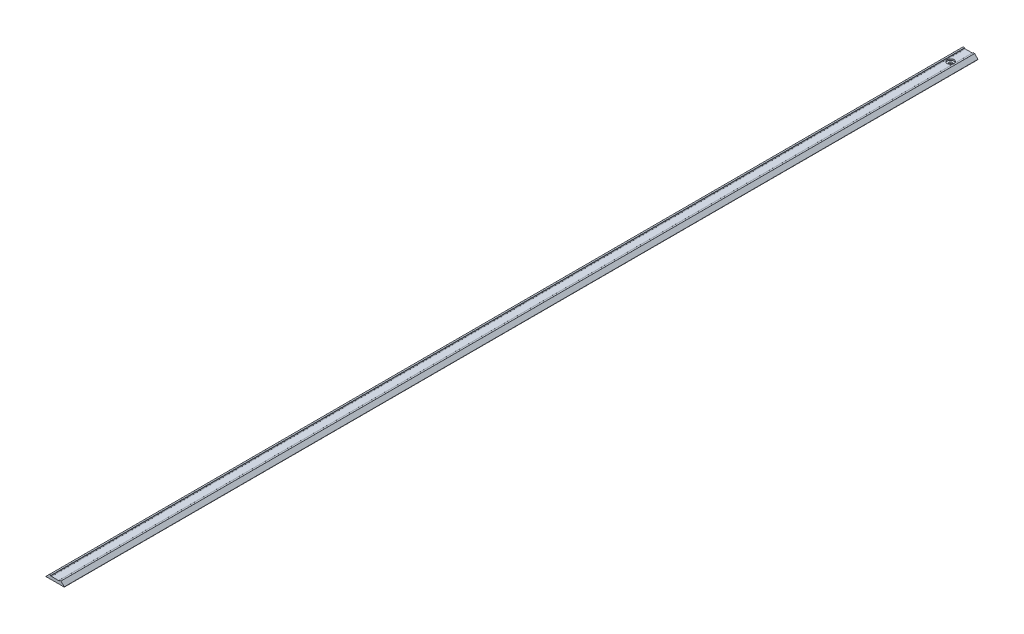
ISO-10303-21;
HEADER;
FILE_DESCRIPTION(('STEP AP214'),'2;1');
FILE_NAME('part.step','',(''),(''),'','','');
FILE_SCHEMA(('AUTOMOTIVE_DESIGN { 1 0 10303 214 1 1 1 1 }'));
ENDSEC;
DATA;
#1=APPLICATION_CONTEXT('core data for automotive mechanical design processes');
#2=APPLICATION_PROTOCOL_DEFINITION('international standard','automotive_design',2000,#1);
#3=PRODUCT_CONTEXT('',#1,'mechanical');
#4=PRODUCT('Part','Part','',(#3));
#5=PRODUCT_RELATED_PRODUCT_CATEGORY('part','',(#4));
#6=PRODUCT_DEFINITION_FORMATION('','',#4);
#7=PRODUCT_DEFINITION_CONTEXT('part definition',#1,'design');
#8=PRODUCT_DEFINITION('design','',#6,#7);
#9=PRODUCT_DEFINITION_SHAPE('','',#8);
#10=(LENGTH_UNIT() NAMED_UNIT(*) SI_UNIT(.MILLI.,.METRE.));
#11=(NAMED_UNIT(*) PLANE_ANGLE_UNIT() SI_UNIT($,.RADIAN.));
#12=(NAMED_UNIT(*) SI_UNIT($,.STERADIAN.) SOLID_ANGLE_UNIT());
#13=UNCERTAINTY_MEASURE_WITH_UNIT(LENGTH_MEASURE(1.E-05),#10,'distance_accuracy_value','');
#14=(GEOMETRIC_REPRESENTATION_CONTEXT(3) GLOBAL_UNCERTAINTY_ASSIGNED_CONTEXT((#13)) GLOBAL_UNIT_ASSIGNED_CONTEXT((#10,
#11,#12)) REPRESENTATION_CONTEXT('',''));
#15=CARTESIAN_POINT('',(0.,0.,0.));
#16=DIRECTION('',(0.,0.,1.));
#17=DIRECTION('',(1.,0.,0.));
#18=AXIS2_PLACEMENT_3D('',#15,#16,#17);
#19=CARTESIAN_POINT('',(3.,0.0499999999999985,1000.));
#20=DIRECTION('',(-1.,0.,0.));
#21=DIRECTION('',(0.,-1.,0.));
#22=AXIS2_PLACEMENT_3D('',#19,#20,#21);
#23=PLANE('',#22);
#24=DIRECTION('',(0.,1.,0.));
#25=VECTOR('',#24,1.);
#26=CARTESIAN_POINT('',(3.,0.0499999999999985,0.));
#27=LINE('',#26,#25);
#28=CARTESIAN_POINT('',(3.,0.,0.));
#29=VERTEX_POINT('',#28);
#30=CARTESIAN_POINT('',(3.,0.0499999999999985,0.));
#31=VERTEX_POINT('',#30);
#32=EDGE_CURVE('E300',#29,#31,#27,.T.);
#33=ORIENTED_EDGE('',*,*,#32,.T.);
#34=DIRECTION('',(0.,0.,-1.));
#35=VECTOR('',#34,1.);
#36=CARTESIAN_POINT('',(3.,0.0499999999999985,1000.));
#37=LINE('',#36,#35);
#38=CARTESIAN_POINT('',(3.,0.0499999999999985,1000.));
#39=VERTEX_POINT('',#38);
#40=EDGE_CURVE('E11',#39,#31,#37,.T.);
#41=ORIENTED_EDGE('',*,*,#40,.F.);
#42=DIRECTION('',(0.,1.,0.));
#43=VECTOR('',#42,1.);
#44=CARTESIAN_POINT('',(3.,0.0499999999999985,1000.));
#45=LINE('',#44,#43);
#46=CARTESIAN_POINT('',(3.,0.,1000.));
#47=VERTEX_POINT('',#46);
#48=EDGE_CURVE('E371',#47,#39,#45,.T.);
#49=ORIENTED_EDGE('',*,*,#48,.F.);
#50=DIRECTION('',(0.,0.,-1.));
#51=VECTOR('',#50,1.);
#52=CARTESIAN_POINT('',(3.,0.,1000.));
#53=LINE('',#52,#51);
#54=EDGE_CURVE('E296',#47,#29,#53,.T.);
#55=ORIENTED_EDGE('',*,*,#54,.T.);
#56=EDGE_LOOP('',(#33,#41,#49,#55));
#57=FACE_BOUND('',#56,.T.);
#58=ADVANCED_FACE('F35',(#57),#23,.F.);
#59=CARTESIAN_POINT('',(17.,0.0500000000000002,1000.));
#60=DIRECTION('',(0.,1.,0.));
#61=DIRECTION('',(-1.,0.,0.));
#62=AXIS2_PLACEMENT_3D('',#59,#60,#61);
#63=PLANE('',#62);
#64=CARTESIAN_POINT('',(10.,0.0499999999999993,20.));
#65=DIRECTION('',(0.,1.,0.));
#66=DIRECTION('',(-1.,0.,0.));
#67=AXIS2_PLACEMENT_3D('',#64,#65,#66);
#68=CIRCLE('',#67,1.7);
#69=CARTESIAN_POINT('',(8.30000000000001,0.0499999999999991,20.));
#70=VERTEX_POINT('',#69);
#71=EDGE_CURVE('E38',#70,#70,#68,.T.);
#72=ORIENTED_EDGE('',*,*,#71,.T.);
#73=EDGE_LOOP('',(#72));
#74=FACE_BOUND('',#73,.T.);
#75=DIRECTION('',(1.,0.,0.));
#76=VECTOR('',#75,1.);
#77=CARTESIAN_POINT('',(17.,0.0500000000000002,0.));
#78=LINE('',#77,#76);
#79=CARTESIAN_POINT('',(17.,0.0500000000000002,0.));
#80=VERTEX_POINT('',#79);
#81=EDGE_CURVE('E303',#31,#80,#78,.T.);
#82=ORIENTED_EDGE('',*,*,#81,.T.);
#83=DIRECTION('',(0.,0.,-1.));
#84=VECTOR('',#83,1.);
#85=CARTESIAN_POINT('',(17.,0.0500000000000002,1000.));
#86=LINE('',#85,#84);
#87=CARTESIAN_POINT('',(17.,0.0500000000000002,1000.));
#88=VERTEX_POINT('',#87);
#89=EDGE_CURVE('E44',#88,#80,#86,.T.);
#90=ORIENTED_EDGE('',*,*,#89,.F.);
#91=DIRECTION('',(1.,0.,0.));
#92=VECTOR('',#91,1.);
#93=CARTESIAN_POINT('',(17.,0.0500000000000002,1000.));
#94=LINE('',#93,#92);
#95=EDGE_CURVE('E179',#39,#88,#94,.T.);
#96=ORIENTED_EDGE('',*,*,#95,.F.);
#97=ORIENTED_EDGE('',*,*,#40,.T.);
#98=EDGE_LOOP('',(#82,#90,#96,#97));
#99=FACE_BOUND('',#98,.T.);
#100=ADVANCED_FACE('F570',(#74,#99),#63,.F.);
#101=CARTESIAN_POINT('',(17.,0.,1000.));
#102=DIRECTION('',(1.,0.,0.));
#103=DIRECTION('',(0.,0.,-1.));
#104=AXIS2_PLACEMENT_3D('',#101,#102,#103);
#105=PLANE('',#104);
#106=DIRECTION('',(0.,-1.,0.));
#107=VECTOR('',#106,1.);
#108=CARTESIAN_POINT('',(17.,0.,0.));
#109=LINE('',#108,#107);
#110=CARTESIAN_POINT('',(17.,0.,0.));
#111=VERTEX_POINT('',#110);
#112=EDGE_CURVE('E305',#80,#111,#109,.T.);
#113=ORIENTED_EDGE('',*,*,#112,.T.);
#114=DIRECTION('',(0.,0.,-1.));
#115=VECTOR('',#114,1.);
#116=CARTESIAN_POINT('',(17.,0.,1000.));
#117=LINE('',#116,#115);
#118=CARTESIAN_POINT('',(17.,0.,1000.));
#119=VERTEX_POINT('',#118);
#120=EDGE_CURVE('E462',#119,#111,#117,.T.);
#121=ORIENTED_EDGE('',*,*,#120,.F.);
#122=DIRECTION('',(0.,-1.,0.));
#123=VECTOR('',#122,1.);
#124=CARTESIAN_POINT('',(17.,0.,1000.));
#125=LINE('',#124,#123);
#126=EDGE_CURVE('E471',#88,#119,#125,.T.);
#127=ORIENTED_EDGE('',*,*,#126,.F.);
#128=ORIENTED_EDGE('',*,*,#89,.T.);
#129=EDGE_LOOP('',(#113,#121,#127,#128));
#130=FACE_BOUND('',#129,.T.);
#131=ADVANCED_FACE('F469',(#130),#105,.F.);
#132=CARTESIAN_POINT('',(19.9,0.,1000.));
#133=DIRECTION('',(0.,1.,0.));
#134=DIRECTION('',(-1.,0.,0.));
#135=AXIS2_PLACEMENT_3D('',#132,#133,#134);
#136=PLANE('',#135);
#137=DIRECTION('',(1.,0.,0.));
#138=VECTOR('',#137,1.);
#139=CARTESIAN_POINT('',(19.9,0.,0.));
#140=LINE('',#139,#138);
#141=CARTESIAN_POINT('',(19.9,0.,0.));
#142=VERTEX_POINT('',#141);
#143=EDGE_CURVE('E307',#111,#142,#140,.T.);
#144=ORIENTED_EDGE('',*,*,#143,.T.);
#145=DIRECTION('',(0.,0.,-1.));
#146=VECTOR('',#145,1.);
#147=CARTESIAN_POINT('',(19.9,0.,1000.));
#148=LINE('',#147,#146);
#149=CARTESIAN_POINT('',(19.9,0.,1000.));
#150=VERTEX_POINT('',#149);
#151=EDGE_CURVE('E459',#150,#142,#148,.T.);
#152=ORIENTED_EDGE('',*,*,#151,.F.);
#153=DIRECTION('',(1.,0.,0.));
#154=VECTOR('',#153,1.);
#155=CARTESIAN_POINT('',(19.9,0.,1000.));
#156=LINE('',#155,#154);
#157=EDGE_CURVE('E489',#119,#150,#156,.T.);
#158=ORIENTED_EDGE('',*,*,#157,.F.);
#159=ORIENTED_EDGE('',*,*,#120,.T.);
#160=EDGE_LOOP('',(#144,#152,#158,#159));
#161=FACE_BOUND('',#160,.T.);
#162=ADVANCED_FACE('F480',(#161),#136,.F.);
#163=CARTESIAN_POINT('',(19.9,0.1,1000.));
#164=DIRECTION('',(0.,0.,-1.));
#165=DIRECTION('',(-1.,0.,0.));
#166=AXIS2_PLACEMENT_3D('',#163,#164,#165);
#167=CYLINDRICAL_SURFACE('',#166,0.0999999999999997);
#168=CARTESIAN_POINT('',(19.9,0.1,0.));
#169=DIRECTION('',(0.,0.,1.));
#170=DIRECTION('',(-1.,0.,0.));
#171=AXIS2_PLACEMENT_3D('',#168,#169,#170);
#172=CIRCLE('',#171,0.0999999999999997);
#173=CARTESIAN_POINT('',(20.,0.1,0.));
#174=VERTEX_POINT('',#173);
#175=EDGE_CURVE('E309',#142,#174,#172,.T.);
#176=ORIENTED_EDGE('',*,*,#175,.T.);
#177=DIRECTION('',(0.,0.,-1.));
#178=VECTOR('',#177,1.);
#179=CARTESIAN_POINT('',(20.,0.1,1000.));
#180=LINE('',#179,#178);
#181=CARTESIAN_POINT('',(20.,0.1,1000.));
#182=VERTEX_POINT('',#181);
#183=EDGE_CURVE('E456',#182,#174,#180,.T.);
#184=ORIENTED_EDGE('',*,*,#183,.F.);
#185=CARTESIAN_POINT('',(19.9,0.1,1000.));
#186=DIRECTION('',(0.,0.,1.));
#187=DIRECTION('',(-1.,0.,0.));
#188=AXIS2_PLACEMENT_3D('',#185,#186,#187);
#189=CIRCLE('',#188,0.0999999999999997);
#190=EDGE_CURVE('E486',#150,#182,#189,.T.);
#191=ORIENTED_EDGE('',*,*,#190,.F.);
#192=ORIENTED_EDGE('',*,*,#151,.T.);
#193=EDGE_LOOP('',(#176,#184,#191,#192));
#194=FACE_BOUND('',#193,.T.);
#195=ADVANCED_FACE('F484',(#194),#167,.T.);
#196=CARTESIAN_POINT('',(20.,0.25857864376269,1000.));
#197=DIRECTION('',(-1.,0.,0.));
#198=DIRECTION('',(0.,0.,1.));
#199=AXIS2_PLACEMENT_3D('',#196,#197,#198);
#200=PLANE('',#199);
#201=DIRECTION('',(0.,1.,0.));
#202=VECTOR('',#201,1.);
#203=CARTESIAN_POINT('',(20.,0.25857864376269,0.));
#204=LINE('',#203,#202);
#205=CARTESIAN_POINT('',(20.,0.25857864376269,0.));
#206=VERTEX_POINT('',#205);
#207=EDGE_CURVE('E311',#174,#206,#204,.T.);
#208=ORIENTED_EDGE('',*,*,#207,.T.);
#209=DIRECTION('',(0.,0.,-1.));
#210=VECTOR('',#209,1.);
#211=CARTESIAN_POINT('',(20.,0.25857864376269,1000.));
#212=LINE('',#211,#210);
#213=CARTESIAN_POINT('',(20.,0.25857864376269,1000.));
#214=VERTEX_POINT('',#213);
#215=EDGE_CURVE('E453',#214,#206,#212,.T.);
#216=ORIENTED_EDGE('',*,*,#215,.F.);
#217=DIRECTION('',(0.,1.,0.));
#218=VECTOR('',#217,1.);
#219=CARTESIAN_POINT('',(20.,0.25857864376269,1000.));
#220=LINE('',#219,#218);
#221=EDGE_CURVE('E488',#182,#214,#220,.T.);
#222=ORIENTED_EDGE('',*,*,#221,.F.);
#223=ORIENTED_EDGE('',*,*,#183,.T.);
#224=EDGE_LOOP('',(#208,#216,#222,#223));
#225=FACE_BOUND('',#224,.T.);
#226=ADVANCED_FACE('F585',(#225),#200,.F.);
#227=CARTESIAN_POINT('',(19.9,0.258578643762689,1000.));
#228=DIRECTION('',(0.,0.,-1.));
#229=DIRECTION('',(-1.,0.,0.));
#230=AXIS2_PLACEMENT_3D('',#227,#228,#229);
#231=CYLINDRICAL_SURFACE('',#230,0.0999999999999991);
#232=CARTESIAN_POINT('',(19.9,0.258578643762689,0.));
#233=DIRECTION('',(0.,0.,1.));
#234=DIRECTION('',(-1.,0.,0.));
#235=AXIS2_PLACEMENT_3D('',#232,#233,#234);
#236=CIRCLE('',#235,0.0999999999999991);
#237=CARTESIAN_POINT('',(19.9707106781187,0.329289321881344,0.));
#238=VERTEX_POINT('',#237);
#239=EDGE_CURVE('E313',#206,#238,#236,.T.);
#240=ORIENTED_EDGE('',*,*,#239,.T.);
#241=DIRECTION('',(0.,0.,-1.));
#242=VECTOR('',#241,1.);
#243=CARTESIAN_POINT('',(19.9707106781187,0.329289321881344,1000.));
#244=LINE('',#243,#242);
#245=CARTESIAN_POINT('',(19.9707106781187,0.329289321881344,1000.));
#246=VERTEX_POINT('',#245);
#247=EDGE_CURVE('E450',#246,#238,#244,.T.);
#248=ORIENTED_EDGE('',*,*,#247,.F.);
#249=CARTESIAN_POINT('',(19.9,0.258578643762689,1000.));
#250=DIRECTION('',(0.,0.,1.));
#251=DIRECTION('',(-1.,0.,0.));
#252=AXIS2_PLACEMENT_3D('',#249,#250,#251);
#253=CIRCLE('',#252,0.0999999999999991);
#254=EDGE_CURVE('E491',#214,#246,#253,.T.);
#255=ORIENTED_EDGE('',*,*,#254,.F.);
#256=ORIENTED_EDGE('',*,*,#215,.T.);
#257=EDGE_LOOP('',(#240,#248,#255,#256));
#258=FACE_BOUND('',#257,.T.);
#259=ADVANCED_FACE('F588',(#258),#231,.T.);
#260=CARTESIAN_POINT('',(16.3292893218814,3.97071067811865,1000.));
#261=DIRECTION('',(-0.707106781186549,-0.707106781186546,0.));
#262=DIRECTION('',(0.707106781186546,-0.707106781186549,0.));
#263=AXIS2_PLACEMENT_3D('',#260,#261,#262);
#264=PLANE('',#263);
#265=DIRECTION('',(-0.707106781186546,0.707106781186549,0.));
#266=VECTOR('',#265,1.);
#267=CARTESIAN_POINT('',(16.3292893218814,3.97071067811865,0.));
#268=LINE('',#267,#266);
#269=CARTESIAN_POINT('',(16.3292893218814,3.97071067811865,0.));
#270=VERTEX_POINT('',#269);
#271=EDGE_CURVE('E315',#238,#270,#268,.T.);
#272=ORIENTED_EDGE('',*,*,#271,.T.);
#273=DIRECTION('',(0.,0.,-1.));
#274=VECTOR('',#273,1.);
#275=CARTESIAN_POINT('',(16.3292893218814,3.97071067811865,1000.));
#276=LINE('',#275,#274);
#277=CARTESIAN_POINT('',(16.3292893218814,3.97071067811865,1000.));
#278=VERTEX_POINT('',#277);
#279=EDGE_CURVE('E447',#278,#270,#276,.T.);
#280=ORIENTED_EDGE('',*,*,#279,.F.);
#281=DIRECTION('',(-0.707106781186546,0.707106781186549,0.));
#282=VECTOR('',#281,1.);
#283=CARTESIAN_POINT('',(16.3292893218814,3.97071067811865,1000.));
#284=LINE('',#283,#282);
#285=EDGE_CURVE('E497',#246,#278,#284,.T.);
#286=ORIENTED_EDGE('',*,*,#285,.F.);
#287=ORIENTED_EDGE('',*,*,#247,.T.);
#288=EDGE_LOOP('',(#272,#280,#286,#287));
#289=FACE_BOUND('',#288,.T.);
#290=ADVANCED_FACE('F592',(#289),#264,.F.);
#291=CARTESIAN_POINT('',(16.2585786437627,3.9,1000.));
#292=DIRECTION('',(0.,0.,-1.));
#293=DIRECTION('',(-1.,0.,0.));
#294=AXIS2_PLACEMENT_3D('',#291,#292,#293);
#295=CYLINDRICAL_SURFACE('',#294,0.100000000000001);
#296=CARTESIAN_POINT('',(16.2585786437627,3.9,0.));
#297=DIRECTION('',(0.,0.,1.));
#298=DIRECTION('',(1.,0.,0.));
#299=AXIS2_PLACEMENT_3D('',#296,#297,#298);
#300=CIRCLE('',#299,0.100000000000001);
#301=CARTESIAN_POINT('',(16.2585786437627,4.,0.));
#302=VERTEX_POINT('',#301);
#303=EDGE_CURVE('E317',#270,#302,#300,.T.);
#304=ORIENTED_EDGE('',*,*,#303,.T.);
#305=DIRECTION('',(0.,0.,-1.));
#306=VECTOR('',#305,1.);
#307=CARTESIAN_POINT('',(16.2585786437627,4.,1000.));
#308=LINE('',#307,#306);
#309=CARTESIAN_POINT('',(16.2585786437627,4.,1000.));
#310=VERTEX_POINT('',#309);
#311=EDGE_CURVE('E444',#310,#302,#308,.T.);
#312=ORIENTED_EDGE('',*,*,#311,.F.);
#313=CARTESIAN_POINT('',(16.2585786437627,3.9,1000.));
#314=DIRECTION('',(0.,0.,1.));
#315=DIRECTION('',(1.,0.,0.));
#316=AXIS2_PLACEMENT_3D('',#313,#314,#315);
#317=CIRCLE('',#316,0.100000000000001);
#318=EDGE_CURVE('E499',#278,#310,#317,.T.);
#319=ORIENTED_EDGE('',*,*,#318,.F.);
#320=ORIENTED_EDGE('',*,*,#279,.T.);
#321=EDGE_LOOP('',(#304,#312,#319,#320));
#322=FACE_BOUND('',#321,.T.);
#323=ADVANCED_FACE('F596',(#322),#295,.T.);
#324=CARTESIAN_POINT('',(14.65,4.,1000.));
#325=DIRECTION('',(0.,-1.,0.));
#326=DIRECTION('',(1.,0.,0.));
#327=AXIS2_PLACEMENT_3D('',#324,#325,#326);
#328=PLANE('',#327);
#329=DIRECTION('',(-1.,0.,0.));
#330=VECTOR('',#329,1.);
#331=CARTESIAN_POINT('',(14.65,4.,0.));
#332=LINE('',#331,#330);
#333=CARTESIAN_POINT('',(14.65,4.,0.));
#334=VERTEX_POINT('',#333);
#335=EDGE_CURVE('E319',#302,#334,#332,.T.);
#336=ORIENTED_EDGE('',*,*,#335,.T.);
#337=DIRECTION('',(0.,0.,-1.));
#338=VECTOR('',#337,1.);
#339=CARTESIAN_POINT('',(14.65,4.,1000.));
#340=LINE('',#339,#338);
#341=CARTESIAN_POINT('',(14.65,4.,1000.));
#342=VERTEX_POINT('',#341);
#343=EDGE_CURVE('E441',#342,#334,#340,.T.);
#344=ORIENTED_EDGE('',*,*,#343,.F.);
#345=DIRECTION('',(-1.,0.,0.));
#346=VECTOR('',#345,1.);
#347=CARTESIAN_POINT('',(14.65,4.,1000.));
#348=LINE('',#347,#346);
#349=EDGE_CURVE('E501',#310,#342,#348,.T.);
#350=ORIENTED_EDGE('',*,*,#349,.F.);
#351=ORIENTED_EDGE('',*,*,#311,.T.);
#352=EDGE_LOOP('',(#336,#344,#350,#351));
#353=FACE_BOUND('',#352,.T.);
#354=ADVANCED_FACE('F600',(#353),#328,.F.);
#355=CARTESIAN_POINT('',(14.65,3.85,1000.));
#356=DIRECTION('',(0.,0.,-1.));
#357=DIRECTION('',(-1.,0.,0.));
#358=AXIS2_PLACEMENT_3D('',#355,#356,#357);
#359=CYLINDRICAL_SURFACE('',#358,0.150000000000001);
#360=CARTESIAN_POINT('',(14.65,3.85,0.));
#361=DIRECTION('',(0.,0.,1.));
#362=DIRECTION('',(1.,0.,0.));
#363=AXIS2_PLACEMENT_3D('',#360,#361,#362);
#364=CIRCLE('',#363,0.150000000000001);
#365=CARTESIAN_POINT('',(14.5,3.85,0.));
#366=VERTEX_POINT('',#365);
#367=EDGE_CURVE('E321',#334,#366,#364,.T.);
#368=ORIENTED_EDGE('',*,*,#367,.T.);
#369=DIRECTION('',(0.,0.,-1.));
#370=VECTOR('',#369,1.);
#371=CARTESIAN_POINT('',(14.5,3.85,1000.));
#372=LINE('',#371,#370);
#373=CARTESIAN_POINT('',(14.5,3.85,1000.));
#374=VERTEX_POINT('',#373);
#375=EDGE_CURVE('E438',#374,#366,#372,.T.);
#376=ORIENTED_EDGE('',*,*,#375,.F.);
#377=CARTESIAN_POINT('',(14.65,3.85,1000.));
#378=DIRECTION('',(0.,0.,1.));
#379=DIRECTION('',(1.,0.,0.));
#380=AXIS2_PLACEMENT_3D('',#377,#378,#379);
#381=CIRCLE('',#380,0.150000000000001);
#382=EDGE_CURVE('E503',#342,#374,#381,.T.);
#383=ORIENTED_EDGE('',*,*,#382,.F.);
#384=ORIENTED_EDGE('',*,*,#343,.T.);
#385=EDGE_LOOP('',(#368,#376,#383,#384));
#386=FACE_BOUND('',#385,.T.);
#387=ADVANCED_FACE('F604',(#386),#359,.T.);
#388=CARTESIAN_POINT('',(14.5,3.75,1000.));
#389=DIRECTION('',(1.,0.,0.));
#390=DIRECTION('',(0.,0.,-1.));
#391=AXIS2_PLACEMENT_3D('',#388,#389,#390);
#392=PLANE('',#391);
#393=DIRECTION('',(0.,-1.,0.));
#394=VECTOR('',#393,1.);
#395=CARTESIAN_POINT('',(14.5,3.75,0.));
#396=LINE('',#395,#394);
#397=CARTESIAN_POINT('',(14.5,3.75,0.));
#398=VERTEX_POINT('',#397);
#399=EDGE_CURVE('E323',#366,#398,#396,.T.);
#400=ORIENTED_EDGE('',*,*,#399,.T.);
#401=DIRECTION('',(0.,0.,-1.));
#402=VECTOR('',#401,1.);
#403=CARTESIAN_POINT('',(14.5,3.75,1000.));
#404=LINE('',#403,#402);
#405=CARTESIAN_POINT('',(14.5,3.75,1000.));
#406=VERTEX_POINT('',#405);
#407=EDGE_CURVE('E435',#406,#398,#404,.T.);
#408=ORIENTED_EDGE('',*,*,#407,.F.);
#409=DIRECTION('',(0.,-1.,0.));
#410=VECTOR('',#409,1.);
#411=CARTESIAN_POINT('',(14.5,3.75,1000.));
#412=LINE('',#411,#410);
#413=EDGE_CURVE('E505',#374,#406,#412,.T.);
#414=ORIENTED_EDGE('',*,*,#413,.F.);
#415=ORIENTED_EDGE('',*,*,#375,.T.);
#416=EDGE_LOOP('',(#400,#408,#414,#415));
#417=FACE_BOUND('',#416,.T.);
#418=ADVANCED_FACE('F608',(#417),#392,.F.);
#419=CARTESIAN_POINT('',(14.65,3.75,1000.));
#420=DIRECTION('',(0.,0.,-1.));
#421=DIRECTION('',(-1.,0.,0.));
#422=AXIS2_PLACEMENT_3D('',#419,#420,#421);
#423=CYLINDRICAL_SURFACE('',#422,0.15);
#424=CARTESIAN_POINT('',(14.65,3.75,0.));
#425=DIRECTION('',(0.,0.,1.));
#426=DIRECTION('',(1.,0.,0.));
#427=AXIS2_PLACEMENT_3D('',#424,#425,#426);
#428=CIRCLE('',#427,0.15);
#429=CARTESIAN_POINT('',(14.65,3.6,0.));
#430=VERTEX_POINT('',#429);
#431=EDGE_CURVE('E325',#398,#430,#428,.T.);
#432=ORIENTED_EDGE('',*,*,#431,.T.);
#433=DIRECTION('',(0.,0.,-1.));
#434=VECTOR('',#433,1.);
#435=CARTESIAN_POINT('',(14.65,3.6,1000.));
#436=LINE('',#435,#434);
#437=CARTESIAN_POINT('',(14.65,3.6,1000.));
#438=VERTEX_POINT('',#437);
#439=EDGE_CURVE('E432',#438,#430,#436,.T.);
#440=ORIENTED_EDGE('',*,*,#439,.F.);
#441=CARTESIAN_POINT('',(14.65,3.75,1000.));
#442=DIRECTION('',(0.,0.,1.));
#443=DIRECTION('',(1.,0.,0.));
#444=AXIS2_PLACEMENT_3D('',#441,#442,#443);
#445=CIRCLE('',#444,0.15);
#446=EDGE_CURVE('E507',#406,#438,#445,.T.);
#447=ORIENTED_EDGE('',*,*,#446,.F.);
#448=ORIENTED_EDGE('',*,*,#407,.T.);
#449=EDGE_LOOP('',(#432,#440,#447,#448));
#450=FACE_BOUND('',#449,.T.);
#451=ADVANCED_FACE('F612',(#450),#423,.T.);
#452=CARTESIAN_POINT('',(14.975,3.6,1000.));
#453=DIRECTION('',(0.,1.,0.));
#454=DIRECTION('',(0.,0.,1.));
#455=AXIS2_PLACEMENT_3D('',#452,#453,#454);
#456=PLANE('',#455);
#457=DIRECTION('',(1.,0.,0.));
#458=VECTOR('',#457,1.);
#459=CARTESIAN_POINT('',(14.975,3.6,0.));
#460=LINE('',#459,#458);
#461=CARTESIAN_POINT('',(14.975,3.6,0.));
#462=VERTEX_POINT('',#461);
#463=EDGE_CURVE('E327',#430,#462,#460,.T.);
#464=ORIENTED_EDGE('',*,*,#463,.T.);
#465=DIRECTION('',(0.,0.,-1.));
#466=VECTOR('',#465,1.);
#467=CARTESIAN_POINT('',(14.975,3.6,1000.));
#468=LINE('',#467,#466);
#469=CARTESIAN_POINT('',(14.975,3.6,1000.));
#470=VERTEX_POINT('',#469);
#471=EDGE_CURVE('E429',#470,#462,#468,.T.);
#472=ORIENTED_EDGE('',*,*,#471,.F.);
#473=DIRECTION('',(1.,0.,0.));
#474=VECTOR('',#473,1.);
#475=CARTESIAN_POINT('',(14.975,3.6,1000.));
#476=LINE('',#475,#474);
#477=EDGE_CURVE('E509',#438,#470,#476,.T.);
#478=ORIENTED_EDGE('',*,*,#477,.F.);
#479=ORIENTED_EDGE('',*,*,#439,.T.);
#480=EDGE_LOOP('',(#464,#472,#478,#479));
#481=FACE_BOUND('',#480,.T.);
#482=ADVANCED_FACE('F616',(#481),#456,.F.);
#483=CARTESIAN_POINT('',(14.975,3.45,1000.));
#484=DIRECTION('',(0.,0.,-1.));
#485=DIRECTION('',(-1.,0.,0.));
#486=AXIS2_PLACEMENT_3D('',#483,#484,#485);
#487=CYLINDRICAL_SURFACE('',#486,0.15);
#488=CARTESIAN_POINT('',(14.975,3.45,0.));
#489=DIRECTION('',(0.,0.,-1.));
#490=DIRECTION('',(-1.,0.,0.));
#491=AXIS2_PLACEMENT_3D('',#488,#489,#490);
#492=CIRCLE('',#491,0.15);
#493=CARTESIAN_POINT('',(15.125,3.45,0.));
#494=VERTEX_POINT('',#493);
#495=EDGE_CURVE('E329',#462,#494,#492,.T.);
#496=ORIENTED_EDGE('',*,*,#495,.T.);
#497=DIRECTION('',(0.,0.,-1.));
#498=VECTOR('',#497,1.);
#499=CARTESIAN_POINT('',(15.125,3.45,1000.));
#500=LINE('',#499,#498);
#501=CARTESIAN_POINT('',(15.125,3.45,1000.));
#502=VERTEX_POINT('',#501);
#503=EDGE_CURVE('E426',#502,#494,#500,.T.);
#504=ORIENTED_EDGE('',*,*,#503,.F.);
#505=CARTESIAN_POINT('',(14.975,3.45,1000.));
#506=DIRECTION('',(0.,0.,-1.));
#507=DIRECTION('',(-1.,0.,0.));
#508=AXIS2_PLACEMENT_3D('',#505,#506,#507);
#509=CIRCLE('',#508,0.15);
#510=EDGE_CURVE('E511',#470,#502,#509,.T.);
#511=ORIENTED_EDGE('',*,*,#510,.F.);
#512=ORIENTED_EDGE('',*,*,#471,.T.);
#513=EDGE_LOOP('',(#496,#504,#511,#512));
#514=FACE_BOUND('',#513,.T.);
#515=ADVANCED_FACE('F620',(#514),#487,.F.);
#516=CARTESIAN_POINT('',(15.125,3.4,1000.));
#517=DIRECTION('',(1.,0.,0.));
#518=DIRECTION('',(0.,0.,-1.));
#519=AXIS2_PLACEMENT_3D('',#516,#517,#518);
#520=PLANE('',#519);
#521=DIRECTION('',(0.,-1.,0.));
#522=VECTOR('',#521,1.);
#523=CARTESIAN_POINT('',(15.125,3.4,0.));
#524=LINE('',#523,#522);
#525=CARTESIAN_POINT('',(15.125,3.4,0.));
#526=VERTEX_POINT('',#525);
#527=EDGE_CURVE('E331',#494,#526,#524,.T.);
#528=ORIENTED_EDGE('',*,*,#527,.T.);
#529=DIRECTION('',(0.,0.,-1.));
#530=VECTOR('',#529,1.);
#531=CARTESIAN_POINT('',(15.125,3.4,1000.));
#532=LINE('',#531,#530);
#533=CARTESIAN_POINT('',(15.125,3.4,1000.));
#534=VERTEX_POINT('',#533);
#535=EDGE_CURVE('E423',#534,#526,#532,.T.);
#536=ORIENTED_EDGE('',*,*,#535,.F.);
#537=DIRECTION('',(0.,-1.,0.));
#538=VECTOR('',#537,1.);
#539=CARTESIAN_POINT('',(15.125,3.4,1000.));
#540=LINE('',#539,#538);
#541=EDGE_CURVE('E513',#502,#534,#540,.T.);
#542=ORIENTED_EDGE('',*,*,#541,.F.);
#543=ORIENTED_EDGE('',*,*,#503,.T.);
#544=EDGE_LOOP('',(#528,#536,#542,#543));
#545=FACE_BOUND('',#544,.T.);
#546=ADVANCED_FACE('F624',(#545),#520,.F.);
#547=CARTESIAN_POINT('',(14.975,3.4,1000.));
#548=DIRECTION('',(0.,0.,-1.));
#549=DIRECTION('',(-1.,0.,0.));
#550=AXIS2_PLACEMENT_3D('',#547,#548,#549);
#551=CYLINDRICAL_SURFACE('',#550,0.15);
#552=CARTESIAN_POINT('',(14.975,3.4,0.));
#553=DIRECTION('',(0.,0.,-1.));
#554=DIRECTION('',(-1.,0.,0.));
#555=AXIS2_PLACEMENT_3D('',#552,#553,#554);
#556=CIRCLE('',#555,0.15);
#557=CARTESIAN_POINT('',(14.975,3.25,0.));
#558=VERTEX_POINT('',#557);
#559=EDGE_CURVE('E333',#526,#558,#556,.T.);
#560=ORIENTED_EDGE('',*,*,#559,.T.);
#561=DIRECTION('',(0.,0.,-1.));
#562=VECTOR('',#561,1.);
#563=CARTESIAN_POINT('',(14.975,3.25,1000.));
#564=LINE('',#563,#562);
#565=CARTESIAN_POINT('',(14.975,3.25,1000.));
#566=VERTEX_POINT('',#565);
#567=EDGE_CURVE('E420',#566,#558,#564,.T.);
#568=ORIENTED_EDGE('',*,*,#567,.F.);
#569=CARTESIAN_POINT('',(14.975,3.4,1000.));
#570=DIRECTION('',(0.,0.,-1.));
#571=DIRECTION('',(-1.,0.,0.));
#572=AXIS2_PLACEMENT_3D('',#569,#570,#571);
#573=CIRCLE('',#572,0.15);
#574=EDGE_CURVE('E515',#534,#566,#573,.T.);
#575=ORIENTED_EDGE('',*,*,#574,.F.);
#576=ORIENTED_EDGE('',*,*,#535,.T.);
#577=EDGE_LOOP('',(#560,#568,#575,#576));
#578=FACE_BOUND('',#577,.T.);
#579=ADVANCED_FACE('F628',(#578),#551,.F.);
#580=CARTESIAN_POINT('',(14.,3.25,1000.));
#581=DIRECTION('',(0.,-1.,0.));
#582=DIRECTION('',(0.,0.,-1.));
#583=AXIS2_PLACEMENT_3D('',#580,#581,#582);
#584=PLANE('',#583);
#585=DIRECTION('',(-1.,0.,0.));
#586=VECTOR('',#585,1.);
#587=CARTESIAN_POINT('',(14.,3.25,0.));
#588=LINE('',#587,#586);
#589=CARTESIAN_POINT('',(14.,3.25,0.));
#590=VERTEX_POINT('',#589);
#591=EDGE_CURVE('E335',#558,#590,#588,.T.);
#592=ORIENTED_EDGE('',*,*,#591,.T.);
#593=DIRECTION('',(0.,0.,-1.));
#594=VECTOR('',#593,1.);
#595=CARTESIAN_POINT('',(14.,3.25,1000.));
#596=LINE('',#595,#594);
#597=CARTESIAN_POINT('',(14.,3.25,1000.));
#598=VERTEX_POINT('',#597);
#599=EDGE_CURVE('E417',#598,#590,#596,.T.);
#600=ORIENTED_EDGE('',*,*,#599,.F.);
#601=DIRECTION('',(-1.,0.,0.));
#602=VECTOR('',#601,1.);
#603=CARTESIAN_POINT('',(14.,3.25,1000.));
#604=LINE('',#603,#602);
#605=EDGE_CURVE('E517',#566,#598,#604,.T.);
#606=ORIENTED_EDGE('',*,*,#605,.F.);
#607=ORIENTED_EDGE('',*,*,#567,.T.);
#608=EDGE_LOOP('',(#592,#600,#606,#607));
#609=FACE_BOUND('',#608,.T.);
#610=ADVANCED_FACE('F632',(#609),#584,.F.);
#611=CARTESIAN_POINT('',(14.,3.25,1000.));
#612=DIRECTION('',(1.,0.,0.));
#613=DIRECTION('',(0.,0.,-1.));
#614=AXIS2_PLACEMENT_3D('',#611,#612,#613);
#615=PLANE('',#614);
#616=DIRECTION('',(0.,-1.,0.));
#617=VECTOR('',#616,1.);
#618=CARTESIAN_POINT('',(14.,3.25,0.));
#619=LINE('',#618,#617);
#620=CARTESIAN_POINT('',(14.,3.2,0.));
#621=VERTEX_POINT('',#620);
#622=EDGE_CURVE('E337',#590,#621,#619,.T.);
#623=ORIENTED_EDGE('',*,*,#622,.T.);
#624=DIRECTION('',(0.,0.,-1.));
#625=VECTOR('',#624,1.);
#626=CARTESIAN_POINT('',(14.,3.2,1000.));
#627=LINE('',#626,#625);
#628=CARTESIAN_POINT('',(14.,3.2,1000.));
#629=VERTEX_POINT('',#628);
#630=EDGE_CURVE('E414',#629,#621,#627,.T.);
#631=ORIENTED_EDGE('',*,*,#630,.F.);
#632=DIRECTION('',(0.,-1.,0.));
#633=VECTOR('',#632,1.);
#634=CARTESIAN_POINT('',(14.,3.25,1000.));
#635=LINE('',#634,#633);
#636=EDGE_CURVE('E519',#598,#629,#635,.T.);
#637=ORIENTED_EDGE('',*,*,#636,.F.);
#638=ORIENTED_EDGE('',*,*,#599,.T.);
#639=EDGE_LOOP('',(#623,#631,#637,#638));
#640=FACE_BOUND('',#639,.T.);
#641=ADVANCED_FACE('F636',(#640),#615,.F.);
#642=CARTESIAN_POINT('',(6.,3.2,1000.));
#643=DIRECTION('',(0.,-1.,0.));
#644=DIRECTION('',(0.,0.,-1.));
#645=AXIS2_PLACEMENT_3D('',#642,#643,#644);
#646=PLANE('',#645);
#647=CARTESIAN_POINT('',(10.,3.2,20.));
#648=DIRECTION('',(0.,1.,0.));
#649=DIRECTION('',(0.,0.,1.));
#650=AXIS2_PLACEMENT_3D('',#647,#648,#649);
#651=CIRCLE('',#650,3.75);
#652=CARTESIAN_POINT('',(10.,3.2,23.75));
#653=VERTEX_POINT('',#652);
#654=EDGE_CURVE('E773',#653,#653,#651,.T.);
#655=ORIENTED_EDGE('',*,*,#654,.F.);
#656=EDGE_LOOP('',(#655));
#657=FACE_BOUND('',#656,.T.);
#658=DIRECTION('',(-1.,0.,0.));
#659=VECTOR('',#658,1.);
#660=CARTESIAN_POINT('',(6.,3.2,0.));
#661=LINE('',#660,#659);
#662=CARTESIAN_POINT('',(6.,3.2,0.));
#663=VERTEX_POINT('',#662);
#664=EDGE_CURVE('E340',#621,#663,#661,.T.);
#665=ORIENTED_EDGE('',*,*,#664,.T.);
#666=DIRECTION('',(0.,0.,-1.));
#667=VECTOR('',#666,1.);
#668=CARTESIAN_POINT('',(6.,3.2,1000.));
#669=LINE('',#668,#667);
#670=CARTESIAN_POINT('',(6.,3.2,1000.));
#671=VERTEX_POINT('',#670);
#672=EDGE_CURVE('E411',#671,#663,#669,.T.);
#673=ORIENTED_EDGE('',*,*,#672,.F.);
#674=DIRECTION('',(-1.,0.,0.));
#675=VECTOR('',#674,1.);
#676=CARTESIAN_POINT('',(9.9,3.2,1000.));
#677=LINE('',#676,#675);
#678=EDGE_CURVE('E521',#629,#671,#677,.T.);
#679=ORIENTED_EDGE('',*,*,#678,.F.);
#680=ORIENTED_EDGE('',*,*,#630,.T.);
#681=EDGE_LOOP('',(#665,#673,#679,#680));
#682=FACE_BOUND('',#681,.T.);
#683=ADVANCED_FACE('F640',(#657,#682),#646,.F.);
#684=CARTESIAN_POINT('',(6.,3.25,1000.));
#685=DIRECTION('',(-1.,0.,0.));
#686=DIRECTION('',(0.,0.,1.));
#687=AXIS2_PLACEMENT_3D('',#684,#685,#686);
#688=PLANE('',#687);
#689=DIRECTION('',(0.,1.,0.));
#690=VECTOR('',#689,1.);
#691=CARTESIAN_POINT('',(6.,3.25,0.));
#692=LINE('',#691,#690);
#693=CARTESIAN_POINT('',(6.,3.25,0.));
#694=VERTEX_POINT('',#693);
#695=EDGE_CURVE('E342',#663,#694,#692,.T.);
#696=ORIENTED_EDGE('',*,*,#695,.T.);
#697=DIRECTION('',(0.,0.,-1.));
#698=VECTOR('',#697,1.);
#699=CARTESIAN_POINT('',(6.,3.25,1000.));
#700=LINE('',#699,#698);
#701=CARTESIAN_POINT('',(6.,3.25,1000.));
#702=VERTEX_POINT('',#701);
#703=EDGE_CURVE('E408',#702,#694,#700,.T.);
#704=ORIENTED_EDGE('',*,*,#703,.F.);
#705=DIRECTION('',(0.,1.,0.));
#706=VECTOR('',#705,1.);
#707=CARTESIAN_POINT('',(6.,3.25,1000.));
#708=LINE('',#707,#706);
#709=EDGE_CURVE('E523',#671,#702,#708,.T.);
#710=ORIENTED_EDGE('',*,*,#709,.F.);
#711=ORIENTED_EDGE('',*,*,#672,.T.);
#712=EDGE_LOOP('',(#696,#704,#710,#711));
#713=FACE_BOUND('',#712,.T.);
#714=ADVANCED_FACE('F644',(#713),#688,.F.);
#715=CARTESIAN_POINT('',(5.025,3.25,1000.));
#716=DIRECTION('',(0.,-1.,0.));
#717=DIRECTION('',(0.,0.,-1.));
#718=AXIS2_PLACEMENT_3D('',#715,#716,#717);
#719=PLANE('',#718);
#720=DIRECTION('',(-1.,0.,0.));
#721=VECTOR('',#720,1.);
#722=CARTESIAN_POINT('',(5.025,3.25,0.));
#723=LINE('',#722,#721);
#724=CARTESIAN_POINT('',(5.025,3.25,0.));
#725=VERTEX_POINT('',#724);
#726=EDGE_CURVE('E344',#694,#725,#723,.T.);
#727=ORIENTED_EDGE('',*,*,#726,.T.);
#728=DIRECTION('',(0.,0.,-1.));
#729=VECTOR('',#728,1.);
#730=CARTESIAN_POINT('',(5.025,3.25,1000.));
#731=LINE('',#730,#729);
#732=CARTESIAN_POINT('',(5.025,3.25,1000.));
#733=VERTEX_POINT('',#732);
#734=EDGE_CURVE('E405',#733,#725,#731,.T.);
#735=ORIENTED_EDGE('',*,*,#734,.F.);
#736=DIRECTION('',(-1.,0.,0.));
#737=VECTOR('',#736,1.);
#738=CARTESIAN_POINT('',(5.025,3.25,1000.));
#739=LINE('',#738,#737);
#740=EDGE_CURVE('E525',#702,#733,#739,.T.);
#741=ORIENTED_EDGE('',*,*,#740,.F.);
#742=ORIENTED_EDGE('',*,*,#703,.T.);
#743=EDGE_LOOP('',(#727,#735,#741,#742));
#744=FACE_BOUND('',#743,.T.);
#745=ADVANCED_FACE('F648',(#744),#719,.F.);
#746=CARTESIAN_POINT('',(5.025,3.4,1000.));
#747=DIRECTION('',(0.,0.,-1.));
#748=DIRECTION('',(-1.,0.,0.));
#749=AXIS2_PLACEMENT_3D('',#746,#747,#748);
#750=CYLINDRICAL_SURFACE('',#749,0.15);
#751=CARTESIAN_POINT('',(5.025,3.4,0.));
#752=DIRECTION('',(0.,0.,-1.));
#753=DIRECTION('',(-1.,0.,0.));
#754=AXIS2_PLACEMENT_3D('',#751,#752,#753);
#755=CIRCLE('',#754,0.15);
#756=CARTESIAN_POINT('',(4.875,3.4,0.));
#757=VERTEX_POINT('',#756);
#758=EDGE_CURVE('E346',#725,#757,#755,.T.);
#759=ORIENTED_EDGE('',*,*,#758,.T.);
#760=DIRECTION('',(0.,0.,-1.));
#761=VECTOR('',#760,1.);
#762=CARTESIAN_POINT('',(4.875,3.4,1000.));
#763=LINE('',#762,#761);
#764=CARTESIAN_POINT('',(4.875,3.4,1000.));
#765=VERTEX_POINT('',#764);
#766=EDGE_CURVE('E402',#765,#757,#763,.T.);
#767=ORIENTED_EDGE('',*,*,#766,.F.);
#768=CARTESIAN_POINT('',(5.025,3.4,1000.));
#769=DIRECTION('',(0.,0.,-1.));
#770=DIRECTION('',(-1.,0.,0.));
#771=AXIS2_PLACEMENT_3D('',#768,#769,#770);
#772=CIRCLE('',#771,0.15);
#773=EDGE_CURVE('E527',#733,#765,#772,.T.);
#774=ORIENTED_EDGE('',*,*,#773,.F.);
#775=ORIENTED_EDGE('',*,*,#734,.T.);
#776=EDGE_LOOP('',(#759,#767,#774,#775));
#777=FACE_BOUND('',#776,.T.);
#778=ADVANCED_FACE('F652',(#777),#750,.F.);
#779=CARTESIAN_POINT('',(4.875,3.45,1000.));
#780=DIRECTION('',(-1.,0.,0.));
#781=DIRECTION('',(0.,0.,1.));
#782=AXIS2_PLACEMENT_3D('',#779,#780,#781);
#783=PLANE('',#782);
#784=DIRECTION('',(0.,1.,0.));
#785=VECTOR('',#784,1.);
#786=CARTESIAN_POINT('',(4.875,3.45,0.));
#787=LINE('',#786,#785);
#788=CARTESIAN_POINT('',(4.875,3.45,0.));
#789=VERTEX_POINT('',#788);
#790=EDGE_CURVE('E348',#757,#789,#787,.T.);
#791=ORIENTED_EDGE('',*,*,#790,.T.);
#792=DIRECTION('',(0.,0.,-1.));
#793=VECTOR('',#792,1.);
#794=CARTESIAN_POINT('',(4.875,3.45,1000.));
#795=LINE('',#794,#793);
#796=CARTESIAN_POINT('',(4.875,3.45,1000.));
#797=VERTEX_POINT('',#796);
#798=EDGE_CURVE('E399',#797,#789,#795,.T.);
#799=ORIENTED_EDGE('',*,*,#798,.F.);
#800=DIRECTION('',(0.,1.,0.));
#801=VECTOR('',#800,1.);
#802=CARTESIAN_POINT('',(4.875,3.45,1000.));
#803=LINE('',#802,#801);
#804=EDGE_CURVE('E529',#765,#797,#803,.T.);
#805=ORIENTED_EDGE('',*,*,#804,.F.);
#806=ORIENTED_EDGE('',*,*,#766,.T.);
#807=EDGE_LOOP('',(#791,#799,#805,#806));
#808=FACE_BOUND('',#807,.T.);
#809=ADVANCED_FACE('F656',(#808),#783,.F.);
#810=CARTESIAN_POINT('',(5.025,3.45,1000.));
#811=DIRECTION('',(0.,0.,-1.));
#812=DIRECTION('',(-1.,0.,0.));
#813=AXIS2_PLACEMENT_3D('',#810,#811,#812);
#814=CYLINDRICAL_SURFACE('',#813,0.15);
#815=CARTESIAN_POINT('',(5.025,3.45,0.));
#816=DIRECTION('',(0.,0.,-1.));
#817=DIRECTION('',(1.,0.,0.));
#818=AXIS2_PLACEMENT_3D('',#815,#816,#817);
#819=CIRCLE('',#818,0.15);
#820=CARTESIAN_POINT('',(5.025,3.6,0.));
#821=VERTEX_POINT('',#820);
#822=EDGE_CURVE('E350',#789,#821,#819,.T.);
#823=ORIENTED_EDGE('',*,*,#822,.T.);
#824=DIRECTION('',(0.,0.,-1.));
#825=VECTOR('',#824,1.);
#826=CARTESIAN_POINT('',(5.025,3.6,1000.));
#827=LINE('',#826,#825);
#828=CARTESIAN_POINT('',(5.025,3.6,1000.));
#829=VERTEX_POINT('',#828);
#830=EDGE_CURVE('E396',#829,#821,#827,.T.);
#831=ORIENTED_EDGE('',*,*,#830,.F.);
#832=CARTESIAN_POINT('',(5.025,3.45,1000.));
#833=DIRECTION('',(0.,0.,-1.));
#834=DIRECTION('',(1.,0.,0.));
#835=AXIS2_PLACEMENT_3D('',#832,#833,#834);
#836=CIRCLE('',#835,0.15);
#837=EDGE_CURVE('E531',#797,#829,#836,.T.);
#838=ORIENTED_EDGE('',*,*,#837,.F.);
#839=ORIENTED_EDGE('',*,*,#798,.T.);
#840=EDGE_LOOP('',(#823,#831,#838,#839));
#841=FACE_BOUND('',#840,.T.);
#842=ADVANCED_FACE('F660',(#841),#814,.F.);
#843=CARTESIAN_POINT('',(5.35,3.6,1000.));
#844=DIRECTION('',(0.,1.,0.));
#845=DIRECTION('',(0.,0.,1.));
#846=AXIS2_PLACEMENT_3D('',#843,#844,#845);
#847=PLANE('',#846);
#848=DIRECTION('',(1.,0.,0.));
#849=VECTOR('',#848,1.);
#850=CARTESIAN_POINT('',(5.35,3.6,0.));
#851=LINE('',#850,#849);
#852=CARTESIAN_POINT('',(5.35,3.6,0.));
#853=VERTEX_POINT('',#852);
#854=EDGE_CURVE('E352',#821,#853,#851,.T.);
#855=ORIENTED_EDGE('',*,*,#854,.T.);
#856=DIRECTION('',(0.,0.,-1.));
#857=VECTOR('',#856,1.);
#858=CARTESIAN_POINT('',(5.35,3.6,1000.));
#859=LINE('',#858,#857);
#860=CARTESIAN_POINT('',(5.35,3.6,1000.));
#861=VERTEX_POINT('',#860);
#862=EDGE_CURVE('E393',#861,#853,#859,.T.);
#863=ORIENTED_EDGE('',*,*,#862,.F.);
#864=DIRECTION('',(1.,0.,0.));
#865=VECTOR('',#864,1.);
#866=CARTESIAN_POINT('',(5.35,3.6,1000.));
#867=LINE('',#866,#865);
#868=EDGE_CURVE('E533',#829,#861,#867,.T.);
#869=ORIENTED_EDGE('',*,*,#868,.F.);
#870=ORIENTED_EDGE('',*,*,#830,.T.);
#871=EDGE_LOOP('',(#855,#863,#869,#870));
#872=FACE_BOUND('',#871,.T.);
#873=ADVANCED_FACE('F664',(#872),#847,.F.);
#874=CARTESIAN_POINT('',(5.35,3.75,1000.));
#875=DIRECTION('',(0.,0.,-1.));
#876=DIRECTION('',(-1.,0.,0.));
#877=AXIS2_PLACEMENT_3D('',#874,#875,#876);
#878=CYLINDRICAL_SURFACE('',#877,0.15);
#879=CARTESIAN_POINT('',(5.35,3.75,0.));
#880=DIRECTION('',(0.,0.,1.));
#881=DIRECTION('',(-1.,0.,0.));
#882=AXIS2_PLACEMENT_3D('',#879,#880,#881);
#883=CIRCLE('',#882,0.15);
#884=CARTESIAN_POINT('',(5.5,3.75,0.));
#885=VERTEX_POINT('',#884);
#886=EDGE_CURVE('E354',#853,#885,#883,.T.);
#887=ORIENTED_EDGE('',*,*,#886,.T.);
#888=DIRECTION('',(0.,0.,-1.));
#889=VECTOR('',#888,1.);
#890=CARTESIAN_POINT('',(5.5,3.75,1000.));
#891=LINE('',#890,#889);
#892=CARTESIAN_POINT('',(5.5,3.75,1000.));
#893=VERTEX_POINT('',#892);
#894=EDGE_CURVE('E390',#893,#885,#891,.T.);
#895=ORIENTED_EDGE('',*,*,#894,.F.);
#896=CARTESIAN_POINT('',(5.35,3.75,1000.));
#897=DIRECTION('',(0.,0.,1.));
#898=DIRECTION('',(-1.,0.,0.));
#899=AXIS2_PLACEMENT_3D('',#896,#897,#898);
#900=CIRCLE('',#899,0.15);
#901=EDGE_CURVE('E535',#861,#893,#900,.T.);
#902=ORIENTED_EDGE('',*,*,#901,.F.);
#903=ORIENTED_EDGE('',*,*,#862,.T.);
#904=EDGE_LOOP('',(#887,#895,#902,#903));
#905=FACE_BOUND('',#904,.T.);
#906=ADVANCED_FACE('F668',(#905),#878,.T.);
#907=CARTESIAN_POINT('',(5.5,3.85,1000.));
#908=DIRECTION('',(-1.,0.,0.));
#909=DIRECTION('',(0.,0.,1.));
#910=AXIS2_PLACEMENT_3D('',#907,#908,#909);
#911=PLANE('',#910);
#912=DIRECTION('',(0.,1.,0.));
#913=VECTOR('',#912,1.);
#914=CARTESIAN_POINT('',(5.5,3.85,0.));
#915=LINE('',#914,#913);
#916=CARTESIAN_POINT('',(5.5,3.85,0.));
#917=VERTEX_POINT('',#916);
#918=EDGE_CURVE('E356',#885,#917,#915,.T.);
#919=ORIENTED_EDGE('',*,*,#918,.T.);
#920=DIRECTION('',(0.,0.,-1.));
#921=VECTOR('',#920,1.);
#922=CARTESIAN_POINT('',(5.5,3.85,1000.));
#923=LINE('',#922,#921);
#924=CARTESIAN_POINT('',(5.5,3.85,1000.));
#925=VERTEX_POINT('',#924);
#926=EDGE_CURVE('E387',#925,#917,#923,.T.);
#927=ORIENTED_EDGE('',*,*,#926,.F.);
#928=DIRECTION('',(0.,1.,0.));
#929=VECTOR('',#928,1.);
#930=CARTESIAN_POINT('',(5.5,3.85,1000.));
#931=LINE('',#930,#929);
#932=EDGE_CURVE('E537',#893,#925,#931,.T.);
#933=ORIENTED_EDGE('',*,*,#932,.F.);
#934=ORIENTED_EDGE('',*,*,#894,.T.);
#935=EDGE_LOOP('',(#919,#927,#933,#934));
#936=FACE_BOUND('',#935,.T.);
#937=ADVANCED_FACE('F672',(#936),#911,.F.);
#938=CARTESIAN_POINT('',(5.35,3.85,1000.));
#939=DIRECTION('',(0.,0.,-1.));
#940=DIRECTION('',(-1.,0.,0.));
#941=AXIS2_PLACEMENT_3D('',#938,#939,#940);
#942=CYLINDRICAL_SURFACE('',#941,0.15);
#943=CARTESIAN_POINT('',(5.35,3.85,0.));
#944=DIRECTION('',(0.,0.,1.));
#945=DIRECTION('',(-1.,0.,0.));
#946=AXIS2_PLACEMENT_3D('',#943,#944,#945);
#947=CIRCLE('',#946,0.15);
#948=CARTESIAN_POINT('',(5.35,4.,0.));
#949=VERTEX_POINT('',#948);
#950=EDGE_CURVE('E358',#917,#949,#947,.T.);
#951=ORIENTED_EDGE('',*,*,#950,.T.);
#952=DIRECTION('',(0.,0.,-1.));
#953=VECTOR('',#952,1.);
#954=CARTESIAN_POINT('',(5.35,4.,1000.));
#955=LINE('',#954,#953);
#956=CARTESIAN_POINT('',(5.35,4.,1000.));
#957=VERTEX_POINT('',#956);
#958=EDGE_CURVE('E384',#957,#949,#955,.T.);
#959=ORIENTED_EDGE('',*,*,#958,.F.);
#960=CARTESIAN_POINT('',(5.35,3.85,1000.));
#961=DIRECTION('',(0.,0.,1.));
#962=DIRECTION('',(-1.,0.,0.));
#963=AXIS2_PLACEMENT_3D('',#960,#961,#962);
#964=CIRCLE('',#963,0.15);
#965=EDGE_CURVE('E539',#925,#957,#964,.T.);
#966=ORIENTED_EDGE('',*,*,#965,.F.);
#967=ORIENTED_EDGE('',*,*,#926,.T.);
#968=EDGE_LOOP('',(#951,#959,#966,#967));
#969=FACE_BOUND('',#968,.T.);
#970=ADVANCED_FACE('F676',(#969),#942,.T.);
#971=CARTESIAN_POINT('',(3.74142135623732,4.,1000.));
#972=DIRECTION('',(0.,-1.,0.));
#973=DIRECTION('',(0.,0.,-1.));
#974=AXIS2_PLACEMENT_3D('',#971,#972,#973);
#975=PLANE('',#974);
#976=DIRECTION('',(-1.,0.,0.));
#977=VECTOR('',#976,1.);
#978=CARTESIAN_POINT('',(3.74142135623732,4.,0.));
#979=LINE('',#978,#977);
#980=CARTESIAN_POINT('',(3.74142135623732,4.,0.));
#981=VERTEX_POINT('',#980);
#982=EDGE_CURVE('E360',#949,#981,#979,.T.);
#983=ORIENTED_EDGE('',*,*,#982,.T.);
#984=DIRECTION('',(0.,0.,-1.));
#985=VECTOR('',#984,1.);
#986=CARTESIAN_POINT('',(3.74142135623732,4.,1000.));
#987=LINE('',#986,#985);
#988=CARTESIAN_POINT('',(3.74142135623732,4.,1000.));
#989=VERTEX_POINT('',#988);
#990=EDGE_CURVE('E381',#989,#981,#987,.T.);
#991=ORIENTED_EDGE('',*,*,#990,.F.);
#992=DIRECTION('',(-1.,0.,0.));
#993=VECTOR('',#992,1.);
#994=CARTESIAN_POINT('',(3.74142135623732,4.,1000.));
#995=LINE('',#994,#993);
#996=EDGE_CURVE('E541',#957,#989,#995,.T.);
#997=ORIENTED_EDGE('',*,*,#996,.F.);
#998=ORIENTED_EDGE('',*,*,#958,.T.);
#999=EDGE_LOOP('',(#983,#991,#997,#998));
#1000=FACE_BOUND('',#999,.T.);
#1001=ADVANCED_FACE('F680',(#1000),#975,.F.);
#1002=CARTESIAN_POINT('',(3.74142135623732,3.9,1000.));
#1003=DIRECTION('',(0.,0.,-1.));
#1004=DIRECTION('',(-1.,0.,0.));
#1005=AXIS2_PLACEMENT_3D('',#1002,#1003,#1004);
#1006=CYLINDRICAL_SURFACE('',#1005,0.0999999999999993);
#1007=CARTESIAN_POINT('',(3.74142135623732,3.9,0.));
#1008=DIRECTION('',(0.,0.,1.));
#1009=DIRECTION('',(-1.,0.,0.));
#1010=AXIS2_PLACEMENT_3D('',#1007,#1008,#1009);
#1011=CIRCLE('',#1010,0.0999999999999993);
#1012=CARTESIAN_POINT('',(3.67071067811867,3.97071067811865,0.));
#1013=VERTEX_POINT('',#1012);
#1014=EDGE_CURVE('E362',#981,#1013,#1011,.T.);
#1015=ORIENTED_EDGE('',*,*,#1014,.T.);
#1016=DIRECTION('',(0.,0.,-1.));
#1017=VECTOR('',#1016,1.);
#1018=CARTESIAN_POINT('',(3.67071067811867,3.97071067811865,1000.));
#1019=LINE('',#1018,#1017);
#1020=CARTESIAN_POINT('',(3.67071067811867,3.97071067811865,1000.));
#1021=VERTEX_POINT('',#1020);
#1022=EDGE_CURVE('E378',#1021,#1013,#1019,.T.);
#1023=ORIENTED_EDGE('',*,*,#1022,.F.);
#1024=CARTESIAN_POINT('',(3.74142135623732,3.9,1000.));
#1025=DIRECTION('',(0.,0.,1.));
#1026=DIRECTION('',(-1.,0.,0.));
#1027=AXIS2_PLACEMENT_3D('',#1024,#1025,#1026);
#1028=CIRCLE('',#1027,0.0999999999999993);
#1029=EDGE_CURVE('E543',#989,#1021,#1028,.T.);
#1030=ORIENTED_EDGE('',*,*,#1029,.F.);
#1031=ORIENTED_EDGE('',*,*,#990,.T.);
#1032=EDGE_LOOP('',(#1015,#1023,#1030,#1031));
#1033=FACE_BOUND('',#1032,.T.);
#1034=ADVANCED_FACE('F684',(#1033),#1006,.T.);
#1035=CARTESIAN_POINT('',(0.0292893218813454,0.329289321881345,1000.));
#1036=DIRECTION('',(0.707106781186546,-0.707106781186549,0.));
#1037=DIRECTION('',(0.707106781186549,0.707106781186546,0.));
#1038=AXIS2_PLACEMENT_3D('',#1035,#1036,#1037);
#1039=PLANE('',#1038);
#1040=DIRECTION('',(-0.707106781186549,-0.707106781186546,0.));
#1041=VECTOR('',#1040,1.);
#1042=CARTESIAN_POINT('',(0.0292893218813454,0.329289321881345,0.));
#1043=LINE('',#1042,#1041);
#1044=CARTESIAN_POINT('',(0.0292893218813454,0.329289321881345,0.));
#1045=VERTEX_POINT('',#1044);
#1046=EDGE_CURVE('E364',#1013,#1045,#1043,.T.);
#1047=ORIENTED_EDGE('',*,*,#1046,.T.);
#1048=DIRECTION('',(0.,0.,-1.));
#1049=VECTOR('',#1048,1.);
#1050=CARTESIAN_POINT('',(0.0292893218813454,0.329289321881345,1000.));
#1051=LINE('',#1050,#1049);
#1052=CARTESIAN_POINT('',(0.0292893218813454,0.329289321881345,1000.));
#1053=VERTEX_POINT('',#1052);
#1054=EDGE_CURVE('E375',#1053,#1045,#1051,.T.);
#1055=ORIENTED_EDGE('',*,*,#1054,.F.);
#1056=DIRECTION('',(-0.707106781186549,-0.707106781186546,0.));
#1057=VECTOR('',#1056,1.);
#1058=CARTESIAN_POINT('',(0.0292893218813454,0.329289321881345,1000.));
#1059=LINE('',#1058,#1057);
#1060=EDGE_CURVE('E545',#1021,#1053,#1059,.T.);
#1061=ORIENTED_EDGE('',*,*,#1060,.F.);
#1062=ORIENTED_EDGE('',*,*,#1022,.T.);
#1063=EDGE_LOOP('',(#1047,#1055,#1061,#1062));
#1064=FACE_BOUND('',#1063,.T.);
#1065=ADVANCED_FACE('F551',(#1064),#1039,.F.);
#1066=CARTESIAN_POINT('',(0.1,0.25857864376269,1000.));
#1067=DIRECTION('',(0.,0.,-1.));
#1068=DIRECTION('',(-1.,0.,0.));
#1069=AXIS2_PLACEMENT_3D('',#1066,#1067,#1068);
#1070=CYLINDRICAL_SURFACE('',#1069,0.1);
#1071=CARTESIAN_POINT('',(0.1,0.25857864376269,0.));
#1072=DIRECTION('',(0.,0.,1.));
#1073=DIRECTION('',(1.,0.,0.));
#1074=AXIS2_PLACEMENT_3D('',#1071,#1072,#1073);
#1075=CIRCLE('',#1074,0.1);
#1076=CARTESIAN_POINT('',(0.,0.25857864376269,0.));
#1077=VERTEX_POINT('',#1076);
#1078=EDGE_CURVE('E366',#1045,#1077,#1075,.T.);
#1079=ORIENTED_EDGE('',*,*,#1078,.T.);
#1080=DIRECTION('',(0.,0.,-1.));
#1081=VECTOR('',#1080,1.);
#1082=CARTESIAN_POINT('',(0.,0.25857864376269,1000.));
#1083=LINE('',#1082,#1081);
#1084=CARTESIAN_POINT('',(0.,0.25857864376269,1000.));
#1085=VERTEX_POINT('',#1084);
#1086=EDGE_CURVE('E291',#1085,#1077,#1083,.T.);
#1087=ORIENTED_EDGE('',*,*,#1086,.F.);
#1088=CARTESIAN_POINT('',(0.1,0.25857864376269,1000.));
#1089=DIRECTION('',(0.,0.,1.));
#1090=DIRECTION('',(1.,0.,0.));
#1091=AXIS2_PLACEMENT_3D('',#1088,#1089,#1090);
#1092=CIRCLE('',#1091,0.1);
#1093=EDGE_CURVE('E282',#1053,#1085,#1092,.T.);
#1094=ORIENTED_EDGE('',*,*,#1093,.F.);
#1095=ORIENTED_EDGE('',*,*,#1054,.T.);
#1096=EDGE_LOOP('',(#1079,#1087,#1094,#1095));
#1097=FACE_BOUND('',#1096,.T.);
#1098=ADVANCED_FACE('F555',(#1097),#1070,.T.);
#1099=CARTESIAN_POINT('',(0.,0.1,1000.));
#1100=DIRECTION('',(1.,0.,0.));
#1101=DIRECTION('',(0.,0.,-1.));
#1102=AXIS2_PLACEMENT_3D('',#1099,#1100,#1101);
#1103=PLANE('',#1102);
#1104=DIRECTION('',(0.,-1.,0.));
#1105=VECTOR('',#1104,1.);
#1106=CARTESIAN_POINT('',(0.,0.1,0.));
#1107=LINE('',#1106,#1105);
#1108=CARTESIAN_POINT('',(0.,0.1,0.));
#1109=VERTEX_POINT('',#1108);
#1110=EDGE_CURVE('E290',#1077,#1109,#1107,.T.);
#1111=ORIENTED_EDGE('',*,*,#1110,.T.);
#1112=DIRECTION('',(0.,0.,-1.));
#1113=VECTOR('',#1112,1.);
#1114=CARTESIAN_POINT('',(0.,0.1,1000.));
#1115=LINE('',#1114,#1113);
#1116=CARTESIAN_POINT('',(0.,0.1,1000.));
#1117=VERTEX_POINT('',#1116);
#1118=EDGE_CURVE('E287',#1117,#1109,#1115,.T.);
#1119=ORIENTED_EDGE('',*,*,#1118,.F.);
#1120=DIRECTION('',(0.,-1.,0.));
#1121=VECTOR('',#1120,1.);
#1122=CARTESIAN_POINT('',(0.,0.1,1000.));
#1123=LINE('',#1122,#1121);
#1124=EDGE_CURVE('E276',#1085,#1117,#1123,.T.);
#1125=ORIENTED_EDGE('',*,*,#1124,.F.);
#1126=ORIENTED_EDGE('',*,*,#1086,.T.);
#1127=EDGE_LOOP('',(#1111,#1119,#1125,#1126));
#1128=FACE_BOUND('',#1127,.T.);
#1129=ADVANCED_FACE('F288',(#1128),#1103,.F.);
#1130=CARTESIAN_POINT('',(0.1,0.1,1000.));
#1131=DIRECTION('',(0.,0.,-1.));
#1132=DIRECTION('',(-1.,0.,0.));
#1133=AXIS2_PLACEMENT_3D('',#1130,#1131,#1132);
#1134=CYLINDRICAL_SURFACE('',#1133,0.1);
#1135=CARTESIAN_POINT('',(0.1,0.1,0.));
#1136=DIRECTION('',(0.,0.,1.));
#1137=DIRECTION('',(-1.,0.,0.));
#1138=AXIS2_PLACEMENT_3D('',#1135,#1136,#1137);
#1139=CIRCLE('',#1138,0.1);
#1140=CARTESIAN_POINT('',(0.1,0.,0.));
#1141=VERTEX_POINT('',#1140);
#1142=EDGE_CURVE('E165',#1109,#1141,#1139,.T.);
#1143=ORIENTED_EDGE('',*,*,#1142,.T.);
#1144=DIRECTION('',(0.,0.,-1.));
#1145=VECTOR('',#1144,1.);
#1146=CARTESIAN_POINT('',(0.1,0.,1000.));
#1147=LINE('',#1146,#1145);
#1148=CARTESIAN_POINT('',(0.1,0.,1000.));
#1149=VERTEX_POINT('',#1148);
#1150=EDGE_CURVE('E292',#1149,#1141,#1147,.T.);
#1151=ORIENTED_EDGE('',*,*,#1150,.F.);
#1152=CARTESIAN_POINT('',(0.1,0.1,1000.));
#1153=DIRECTION('',(0.,0.,1.));
#1154=DIRECTION('',(-1.,0.,0.));
#1155=AXIS2_PLACEMENT_3D('',#1152,#1153,#1154);
#1156=CIRCLE('',#1155,0.1);
#1157=EDGE_CURVE('E280',#1117,#1149,#1156,.T.);
#1158=ORIENTED_EDGE('',*,*,#1157,.F.);
#1159=ORIENTED_EDGE('',*,*,#1118,.T.);
#1160=EDGE_LOOP('',(#1143,#1151,#1158,#1159));
#1161=FACE_BOUND('',#1160,.T.);
#1162=ADVANCED_FACE('F294',(#1161),#1134,.T.);
#1163=CARTESIAN_POINT('',(0.1,0.,1000.));
#1164=DIRECTION('',(0.,1.,0.));
#1165=DIRECTION('',(0.,0.,1.));
#1166=AXIS2_PLACEMENT_3D('',#1163,#1164,#1165);
#1167=PLANE('',#1166);
#1168=DIRECTION('',(1.,0.,0.));
#1169=VECTOR('',#1168,1.);
#1170=CARTESIAN_POINT('',(0.1,0.,0.));
#1171=LINE('',#1170,#1169);
#1172=EDGE_CURVE('E171',#1141,#29,#1171,.T.);
#1173=ORIENTED_EDGE('',*,*,#1172,.T.);
#1174=ORIENTED_EDGE('',*,*,#54,.F.);
#1175=DIRECTION('',(1.,0.,0.));
#1176=VECTOR('',#1175,1.);
#1177=CARTESIAN_POINT('',(0.1,0.,1000.));
#1178=LINE('',#1177,#1176);
#1179=EDGE_CURVE('E52',#1149,#47,#1178,.T.);
#1180=ORIENTED_EDGE('',*,*,#1179,.F.);
#1181=ORIENTED_EDGE('',*,*,#1150,.T.);
#1182=EDGE_LOOP('',(#1173,#1174,#1180,#1181));
#1183=FACE_BOUND('',#1182,.T.);
#1184=ADVANCED_FACE('F559',(#1183),#1167,.F.);
#1185=CARTESIAN_POINT('',(0.1,0.1,1000.));
#1186=DIRECTION('',(0.,0.,-1.));
#1187=DIRECTION('',(-1.,0.,0.));
#1188=AXIS2_PLACEMENT_3D('',#1185,#1186,#1187);
#1189=PLANE('',#1188);
#1190=ORIENTED_EDGE('',*,*,#48,.T.);
#1191=ORIENTED_EDGE('',*,*,#95,.T.);
#1192=ORIENTED_EDGE('',*,*,#126,.T.);
#1193=ORIENTED_EDGE('',*,*,#157,.T.);
#1194=ORIENTED_EDGE('',*,*,#190,.T.);
#1195=ORIENTED_EDGE('',*,*,#221,.T.);
#1196=ORIENTED_EDGE('',*,*,#254,.T.);
#1197=ORIENTED_EDGE('',*,*,#285,.T.);
#1198=ORIENTED_EDGE('',*,*,#318,.T.);
#1199=ORIENTED_EDGE('',*,*,#349,.T.);
#1200=ORIENTED_EDGE('',*,*,#382,.T.);
#1201=ORIENTED_EDGE('',*,*,#413,.T.);
#1202=ORIENTED_EDGE('',*,*,#446,.T.);
#1203=ORIENTED_EDGE('',*,*,#477,.T.);
#1204=ORIENTED_EDGE('',*,*,#510,.T.);
#1205=ORIENTED_EDGE('',*,*,#541,.T.);
#1206=ORIENTED_EDGE('',*,*,#574,.T.);
#1207=ORIENTED_EDGE('',*,*,#605,.T.);
#1208=ORIENTED_EDGE('',*,*,#636,.T.);
#1209=ORIENTED_EDGE('',*,*,#678,.T.);
#1210=ORIENTED_EDGE('',*,*,#709,.T.);
#1211=ORIENTED_EDGE('',*,*,#740,.T.);
#1212=ORIENTED_EDGE('',*,*,#773,.T.);
#1213=ORIENTED_EDGE('',*,*,#804,.T.);
#1214=ORIENTED_EDGE('',*,*,#837,.T.);
#1215=ORIENTED_EDGE('',*,*,#868,.T.);
#1216=ORIENTED_EDGE('',*,*,#901,.T.);
#1217=ORIENTED_EDGE('',*,*,#932,.T.);
#1218=ORIENTED_EDGE('',*,*,#965,.T.);
#1219=ORIENTED_EDGE('',*,*,#996,.T.);
#1220=ORIENTED_EDGE('',*,*,#1029,.T.);
#1221=ORIENTED_EDGE('',*,*,#1060,.T.);
#1222=ORIENTED_EDGE('',*,*,#1093,.T.);
#1223=ORIENTED_EDGE('',*,*,#1124,.T.);
#1224=ORIENTED_EDGE('',*,*,#1157,.T.);
#1225=ORIENTED_EDGE('',*,*,#1179,.T.);
#1226=EDGE_LOOP('',(#1190,#1191,#1192,#1193,#1194,#1195,#1196,#1197,#1198,#1199,#1200,#1201,
#1202,#1203,#1204,#1205,#1206,#1207,#1208,#1209,#1210,#1211,#1212,#1213,#1214,#1215,#1216,#1217,
#1218,#1219,#1220,#1221,#1222,#1223,#1224,#1225));
#1227=FACE_BOUND('',#1226,.T.);
#1228=ADVANCED_FACE('F278',(#1227),#1189,.F.);
#1229=CARTESIAN_POINT('',(0.1,0.1,0.));
#1230=DIRECTION('',(0.,0.,-1.));
#1231=DIRECTION('',(-1.,0.,0.));
#1232=AXIS2_PLACEMENT_3D('',#1229,#1230,#1231);
#1233=PLANE('',#1232);
#1234=ORIENTED_EDGE('',*,*,#32,.F.);
#1235=ORIENTED_EDGE('',*,*,#1172,.F.);
#1236=ORIENTED_EDGE('',*,*,#1142,.F.);
#1237=ORIENTED_EDGE('',*,*,#1110,.F.);
#1238=ORIENTED_EDGE('',*,*,#1078,.F.);
#1239=ORIENTED_EDGE('',*,*,#1046,.F.);
#1240=ORIENTED_EDGE('',*,*,#1014,.F.);
#1241=ORIENTED_EDGE('',*,*,#982,.F.);
#1242=ORIENTED_EDGE('',*,*,#950,.F.);
#1243=ORIENTED_EDGE('',*,*,#918,.F.);
#1244=ORIENTED_EDGE('',*,*,#886,.F.);
#1245=ORIENTED_EDGE('',*,*,#854,.F.);
#1246=ORIENTED_EDGE('',*,*,#822,.F.);
#1247=ORIENTED_EDGE('',*,*,#790,.F.);
#1248=ORIENTED_EDGE('',*,*,#758,.F.);
#1249=ORIENTED_EDGE('',*,*,#726,.F.);
#1250=ORIENTED_EDGE('',*,*,#695,.F.);
#1251=ORIENTED_EDGE('',*,*,#664,.F.);
#1252=ORIENTED_EDGE('',*,*,#622,.F.);
#1253=ORIENTED_EDGE('',*,*,#591,.F.);
#1254=ORIENTED_EDGE('',*,*,#559,.F.);
#1255=ORIENTED_EDGE('',*,*,#527,.F.);
#1256=ORIENTED_EDGE('',*,*,#495,.F.);
#1257=ORIENTED_EDGE('',*,*,#463,.F.);
#1258=ORIENTED_EDGE('',*,*,#431,.F.);
#1259=ORIENTED_EDGE('',*,*,#399,.F.);
#1260=ORIENTED_EDGE('',*,*,#367,.F.);
#1261=ORIENTED_EDGE('',*,*,#335,.F.);
#1262=ORIENTED_EDGE('',*,*,#303,.F.);
#1263=ORIENTED_EDGE('',*,*,#271,.F.);
#1264=ORIENTED_EDGE('',*,*,#239,.F.);
#1265=ORIENTED_EDGE('',*,*,#207,.F.);
#1266=ORIENTED_EDGE('',*,*,#175,.F.);
#1267=ORIENTED_EDGE('',*,*,#143,.F.);
#1268=ORIENTED_EDGE('',*,*,#112,.F.);
#1269=ORIENTED_EDGE('',*,*,#81,.F.);
#1270=EDGE_LOOP('',(#1234,#1235,#1236,#1237,#1238,#1239,#1240,#1241,#1242,#1243,#1244,#1245,
#1246,#1247,#1248,#1249,#1250,#1251,#1252,#1253,#1254,#1255,#1256,#1257,#1258,#1259,#1260,#1261,
#1262,#1263,#1264,#1265,#1266,#1267,#1268,#1269));
#1271=FACE_BOUND('',#1270,.T.);
#1272=ADVANCED_FACE('F475',(#1271),#1233,.T.);
#1273=CARTESIAN_POINT('',(10.,3.2,20.));
#1274=DIRECTION('',(0.,1.,0.));
#1275=DIRECTION('',(0.,0.,1.));
#1276=AXIS2_PLACEMENT_3D('',#1273,#1274,#1275);
#1277=CYLINDRICAL_SURFACE('',#1276,1.7);
#1278=CARTESIAN_POINT('',(10.,1.7,20.));
#1279=DIRECTION('',(0.,1.,0.));
#1280=DIRECTION('',(0.,0.,1.));
#1281=AXIS2_PLACEMENT_3D('',#1278,#1279,#1280);
#1282=CIRCLE('',#1281,1.7);
#1283=CARTESIAN_POINT('',(10.,1.7,21.7));
#1284=VERTEX_POINT('',#1283);
#1285=EDGE_CURVE('E775',#1284,#1284,#1282,.T.);
#1286=ORIENTED_EDGE('',*,*,#1285,.T.);
#1287=EDGE_LOOP('',(#1286));
#1288=FACE_BOUND('',#1287,.T.);
#1289=ORIENTED_EDGE('',*,*,#71,.F.);
#1290=EDGE_LOOP('',(#1289));
#1291=FACE_BOUND('',#1290,.T.);
#1292=ADVANCED_FACE('F720',(#1288,#1291),#1277,.F.);
#1293=CARTESIAN_POINT('',(11.7,1.7,20.));
#1294=DIRECTION('',(0.,-1.,0.));
#1295=DIRECTION('',(0.,0.,-1.));
#1296=AXIS2_PLACEMENT_3D('',#1293,#1294,#1295);
#1297=PLANE('',#1296);
#1298=ORIENTED_EDGE('',*,*,#1285,.F.);
#1299=EDGE_LOOP('',(#1298));
#1300=FACE_BOUND('',#1299,.T.);
#1301=CARTESIAN_POINT('',(10.,1.7,20.));
#1302=DIRECTION('',(0.,1.,0.));
#1303=DIRECTION('',(0.,0.,1.));
#1304=AXIS2_PLACEMENT_3D('',#1301,#1302,#1303);
#1305=CIRCLE('',#1304,3.75);
#1306=CARTESIAN_POINT('',(10.,1.7,23.75));
#1307=VERTEX_POINT('',#1306);
#1308=EDGE_CURVE('E770',#1307,#1307,#1305,.T.);
#1309=ORIENTED_EDGE('',*,*,#1308,.T.);
#1310=EDGE_LOOP('',(#1309));
#1311=FACE_BOUND('',#1310,.T.);
#1312=ADVANCED_FACE('F743',(#1300,#1311),#1297,.F.);
#1313=CARTESIAN_POINT('',(10.,3.2,20.));
#1314=DIRECTION('',(0.,1.,0.));
#1315=DIRECTION('',(0.,0.,1.));
#1316=AXIS2_PLACEMENT_3D('',#1313,#1314,#1315);
#1317=CYLINDRICAL_SURFACE('',#1316,3.75);
#1318=ORIENTED_EDGE('',*,*,#1308,.F.);
#1319=EDGE_LOOP('',(#1318));
#1320=FACE_BOUND('',#1319,.T.);
#1321=ORIENTED_EDGE('',*,*,#654,.T.);
#1322=EDGE_LOOP('',(#1321));
#1323=FACE_BOUND('',#1322,.T.);
#1324=ADVANCED_FACE('F753',(#1320,#1323),#1317,.F.);
#1325=CLOSED_SHELL('',(#58,#100,#131,#162,#195,#226,#259,#290,#323,#354,#387,#418,#451,#482,
#515,#546,#579,#610,#641,#683,#714,#745,#778,#809,#842,#873,#906,#937,#970,#1001,#1034,#1065,
#1098,#1129,#1162,#1184,#1228,#1272,#1292,#1312,#1324));
#1326=MANIFOLD_SOLID_BREP('B2',#1325);
#1327=ADVANCED_BREP_SHAPE_REPRESENTATION('',(#18,#1326),#14);
#1328=SHAPE_DEFINITION_REPRESENTATION(#9,#1327);
ENDSEC;
END-ISO-10303-21;
